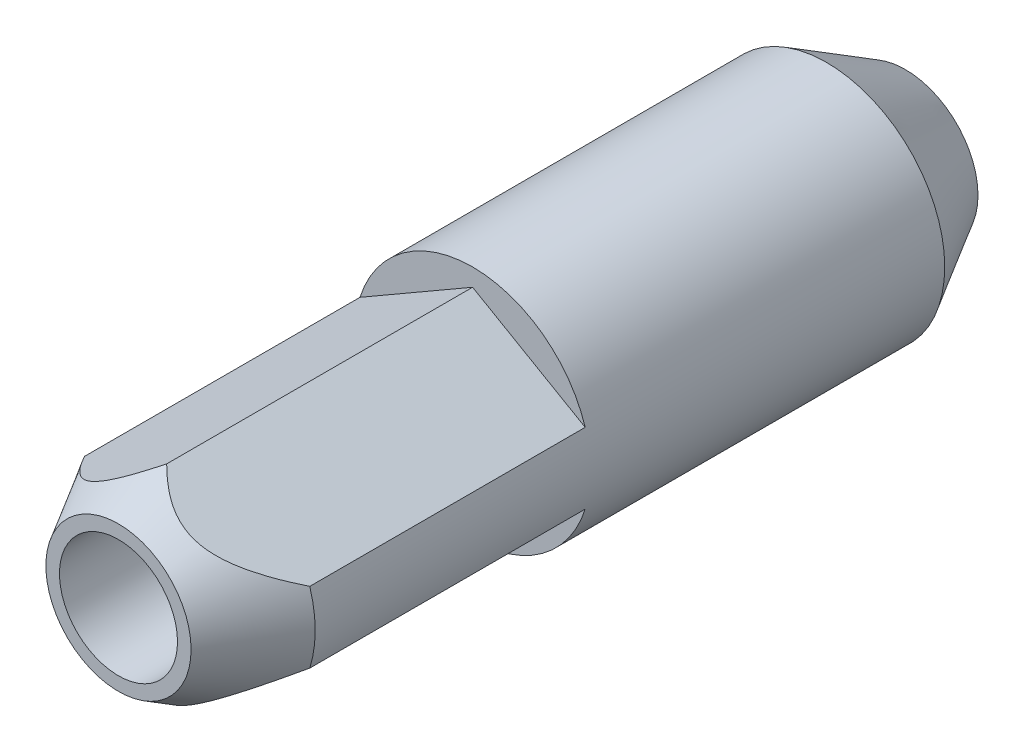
ISO-10303-21;
HEADER;
FILE_DESCRIPTION(('STEP AP214'),'2;1');
FILE_NAME('part.step','',(''),(''),'','','');
FILE_SCHEMA(('AUTOMOTIVE_DESIGN { 1 0 10303 214 1 1 1 1 }'));
ENDSEC;
DATA;
#1=APPLICATION_CONTEXT('core data for automotive mechanical design processes');
#2=APPLICATION_PROTOCOL_DEFINITION('international standard','automotive_design',2000,#1);
#3=PRODUCT_CONTEXT('',#1,'mechanical');
#4=PRODUCT('Part','Part','',(#3));
#5=PRODUCT_RELATED_PRODUCT_CATEGORY('part','',(#4));
#6=PRODUCT_DEFINITION_FORMATION('','',#4);
#7=PRODUCT_DEFINITION_CONTEXT('part definition',#1,'design');
#8=PRODUCT_DEFINITION('design','',#6,#7);
#9=PRODUCT_DEFINITION_SHAPE('','',#8);
#10=(LENGTH_UNIT() NAMED_UNIT(*) SI_UNIT(.MILLI.,.METRE.));
#11=(NAMED_UNIT(*) PLANE_ANGLE_UNIT() SI_UNIT($,.RADIAN.));
#12=(NAMED_UNIT(*) SI_UNIT($,.STERADIAN.) SOLID_ANGLE_UNIT());
#13=UNCERTAINTY_MEASURE_WITH_UNIT(LENGTH_MEASURE(1.E-05),#10,'distance_accuracy_value','');
#14=(GEOMETRIC_REPRESENTATION_CONTEXT(3) GLOBAL_UNCERTAINTY_ASSIGNED_CONTEXT((#13)) GLOBAL_UNIT_ASSIGNED_CONTEXT((#10,
#11,#12)) REPRESENTATION_CONTEXT('',''));
#15=CARTESIAN_POINT('',(0.,0.,0.));
#16=DIRECTION('',(0.,0.,1.));
#17=DIRECTION('',(1.,0.,0.));
#18=AXIS2_PLACEMENT_3D('',#15,#16,#17);
#19=CARTESIAN_POINT('',(0.,0.,18.));
#20=DIRECTION('',(0.,0.,-1.));
#21=DIRECTION('',(-1.,0.,0.));
#22=AXIS2_PLACEMENT_3D('',#19,#20,#21);
#23=CONICAL_SURFACE('',#22,3.,0.523598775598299);
#24=CARTESIAN_POINT('',(0.,0.,20.));
#25=DIRECTION('',(0.,0.,1.));
#26=DIRECTION('',(1.,0.,0.));
#27=AXIS2_PLACEMENT_3D('',#24,#25,#26);
#28=CIRCLE('',#27,1.84529946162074);
#29=CARTESIAN_POINT('',(1.84529946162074,0.,20.));
#30=VERTEX_POINT('',#29);
#31=EDGE_CURVE('E23',#30,#30,#28,.T.);
#32=ORIENTED_EDGE('',*,*,#31,.F.);
#33=EDGE_LOOP('',(#32));
#34=FACE_BOUND('',#33,.T.);
#35=CARTESIAN_POINT('',(-0.000199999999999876,2.55238663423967,18.7752890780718));
#36=CARTESIAN_POINT('',(0.0460344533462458,2.52569316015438,18.8214743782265));
#37=CARTESIAN_POINT('',(0.0931933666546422,2.49846594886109,18.8665157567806));
#38=CARTESIAN_POINT('',(0.189955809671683,2.44260012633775,18.9535711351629));
#39=CARTESIAN_POINT('',(0.239571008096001,2.41395477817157,18.9955677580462));
#40=CARTESIAN_POINT('',(0.34269103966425,2.3544184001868,19.0763265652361));
#41=CARTESIAN_POINT('',(0.396263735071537,2.32348819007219,19.1149751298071));
#42=CARTESIAN_POINT('',(0.506284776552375,2.25996751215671,19.186101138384));
#43=CARTESIAN_POINT('',(0.562726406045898,2.22738092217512,19.2185922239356));
#44=CARTESIAN_POINT('',(0.683762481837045,2.15750071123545,19.2779748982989));
#45=CARTESIAN_POINT('',(0.748638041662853,2.12004478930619,19.3041269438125));
#46=CARTESIAN_POINT('',(0.880771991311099,2.04375721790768,19.3437172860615));
#47=CARTESIAN_POINT('',(0.948006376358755,2.00493942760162,19.3572584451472));
#48=CARTESIAN_POINT('',(1.08417192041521,1.92632421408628,19.3699471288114));
#49=CARTESIAN_POINT('',(1.15311305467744,1.88652103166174,19.3689592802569));
#50=CARTESIAN_POINT('',(1.28973218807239,1.80764393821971,19.3524236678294));
#51=CARTESIAN_POINT('',(1.35740744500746,1.76857161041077,19.3368473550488));
#52=CARTESIAN_POINT('',(1.50861090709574,1.6812742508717,19.2872489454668));
#53=CARTESIAN_POINT('',(1.59113279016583,1.63363021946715,19.2492234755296));
#54=CARTESIAN_POINT('',(1.71058416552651,1.56466493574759,19.1815694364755));
#55=CARTESIAN_POINT('',(1.74986876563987,1.54198396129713,19.1570960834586));
#56=CARTESIAN_POINT('',(1.82697593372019,1.49746611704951,19.105250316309));
#57=CARTESIAN_POINT('',(1.86479886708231,1.47562903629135,19.0778786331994));
#58=CARTESIAN_POINT('',(1.94909791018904,1.42695896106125,19.0130933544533));
#59=CARTESIAN_POINT('',(1.99515689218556,1.40036679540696,18.9749623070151));
#60=CARTESIAN_POINT('',(2.08535834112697,1.34828896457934,18.8957734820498));
#61=CARTESIAN_POINT('',(2.12950000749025,1.32280376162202,18.8547145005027));
#62=CARTESIAN_POINT('',(2.25966628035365,1.24765222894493,18.7279277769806));
#63=CARTESIAN_POINT('',(2.34319057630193,1.19942945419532,18.6387853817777));
#64=CARTESIAN_POINT('',(2.50121771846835,1.10819244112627,18.459425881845));
#65=CARTESIAN_POINT('',(2.5759629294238,1.0650382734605,18.369486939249));
#66=CARTESIAN_POINT('',(2.68528856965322,1.00191908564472,18.2322142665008));
#67=CARTESIAN_POINT('',(2.72114587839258,0.981216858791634,18.1862256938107));
#68=CARTESIAN_POINT('',(2.79211447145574,0.940243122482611,18.0935055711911));
#69=CARTESIAN_POINT('',(2.82722592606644,0.919971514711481,18.0467741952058));
#70=CARTESIAN_POINT('',(2.86201760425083,0.899884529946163,17.99972953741));
#71=B_SPLINE_CURVE_WITH_KNOTS('',3,(#35,#36,#37,#38,#39,#40,#41,#42,#43,#44,#45,#46,#47,#48,#49,
#50,#51,#52,#53,#54,#55,#56,#57,#58,#59,#60,#61,#62,#63,#64,#65,#66,#67,#68,#69,#70),
.UNSPECIFIED.,.F.,.F.,(4,2,2,2,2,2,2,2,2,2,2,2,2,2,2,2,2,4),(0.,0.211847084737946,
0.424820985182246,0.643376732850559,0.861442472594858,1.09860494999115,1.33381558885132,
1.57121916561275,1.80908830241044,2.11503689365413,2.26959857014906,2.42412135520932,
2.62031527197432,2.81659033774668,3.21015736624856,3.58398424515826,3.76961845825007,
3.9552098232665),.UNSPECIFIED.);
#72=CARTESIAN_POINT('',(0.,2.55227116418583,18.7754890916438));
#73=VERTEX_POINT('',#72);
#74=CARTESIAN_POINT('',(2.86181760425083,0.9,18.));
#75=VERTEX_POINT('',#74);
#76=EDGE_CURVE('E102',#73,#75,#71,.T.);
#77=ORIENTED_EDGE('',*,*,#76,.F.);
#78=CARTESIAN_POINT('',(0.000199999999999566,2.55238663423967,18.7752890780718));
#79=CARTESIAN_POINT('',(-0.0460344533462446,2.52569316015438,18.8214743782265));
#80=CARTESIAN_POINT('',(-0.0931933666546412,2.49846594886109,18.8665157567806));
#81=CARTESIAN_POINT('',(-0.189955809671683,2.44260012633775,18.9535711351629));
#82=CARTESIAN_POINT('',(-0.239571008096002,2.41395477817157,18.9955677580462));
#83=CARTESIAN_POINT('',(-0.342691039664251,2.3544184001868,19.0763265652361));
#84=CARTESIAN_POINT('',(-0.396263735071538,2.32348819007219,19.1149751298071));
#85=CARTESIAN_POINT('',(-0.506284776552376,2.25996751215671,19.186101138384));
#86=CARTESIAN_POINT('',(-0.562726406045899,2.22738092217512,19.2185922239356));
#87=CARTESIAN_POINT('',(-0.683762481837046,2.15750071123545,19.2779748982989));
#88=CARTESIAN_POINT('',(-0.748638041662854,2.12004478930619,19.3041269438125));
#89=CARTESIAN_POINT('',(-0.8807719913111,2.04375721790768,19.3437172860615));
#90=CARTESIAN_POINT('',(-0.948006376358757,2.00493942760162,19.3572584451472));
#91=CARTESIAN_POINT('',(-1.08417192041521,1.92632421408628,19.3699471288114));
#92=CARTESIAN_POINT('',(-1.15311305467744,1.88652103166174,19.3689592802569));
#93=CARTESIAN_POINT('',(-1.28973218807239,1.80764393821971,19.3524236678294));
#94=CARTESIAN_POINT('',(-1.35740744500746,1.76857161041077,19.3368473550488));
#95=CARTESIAN_POINT('',(-1.50861090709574,1.6812742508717,19.2872489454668));
#96=CARTESIAN_POINT('',(-1.59113279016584,1.63363021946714,19.2492234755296));
#97=CARTESIAN_POINT('',(-1.71058416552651,1.56466493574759,19.1815694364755));
#98=CARTESIAN_POINT('',(-1.74986876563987,1.54198396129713,19.1570960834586));
#99=CARTESIAN_POINT('',(-1.82697593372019,1.49746611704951,19.105250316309));
#100=CARTESIAN_POINT('',(-1.86479886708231,1.47562903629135,19.0778786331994));
#101=CARTESIAN_POINT('',(-1.94909791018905,1.42695896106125,19.0130933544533));
#102=CARTESIAN_POINT('',(-1.99515689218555,1.40036679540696,18.9749623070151));
#103=CARTESIAN_POINT('',(-2.08535834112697,1.34828896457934,18.8957734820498));
#104=CARTESIAN_POINT('',(-2.12950000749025,1.32280376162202,18.8547145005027));
#105=CARTESIAN_POINT('',(-2.25966628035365,1.24765222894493,18.7279277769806));
#106=CARTESIAN_POINT('',(-2.34319057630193,1.19942945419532,18.6387853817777));
#107=CARTESIAN_POINT('',(-2.50121771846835,1.10819244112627,18.459425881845));
#108=CARTESIAN_POINT('',(-2.5759629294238,1.0650382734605,18.369486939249));
#109=CARTESIAN_POINT('',(-2.68528856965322,1.00191908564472,18.2322142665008));
#110=CARTESIAN_POINT('',(-2.72114587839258,0.981216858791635,18.1862256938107));
#111=CARTESIAN_POINT('',(-2.79211447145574,0.94024312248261,18.0935055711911));
#112=CARTESIAN_POINT('',(-2.82722592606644,0.91997151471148,18.0467741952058));
#113=CARTESIAN_POINT('',(-2.86201760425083,0.899884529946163,17.99972953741));
#114=B_SPLINE_CURVE_WITH_KNOTS('',3,(#78,#79,#80,#81,#82,#83,#84,#85,#86,#87,#88,#89,#90,#91,
#92,#93,#94,#95,#96,#97,#98,#99,#100,#101,#102,#103,#104,#105,#106,#107,#108,#109,#110,#111,
#112,#113),.UNSPECIFIED.,.F.,.F.,(4,2,2,2,2,2,2,2,2,2,2,2,2,2,2,2,2,4),(0.,0.211847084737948,
0.424820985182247,0.64337673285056,0.861442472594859,1.09860494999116,1.33381558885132,
1.57121916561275,1.80908830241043,2.11503689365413,2.26959857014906,2.42412135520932,
2.62031527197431,2.81659033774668,3.21015736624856,3.58398424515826,3.76961845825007,
3.9552098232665),.UNSPECIFIED.);
#115=CARTESIAN_POINT('',(-2.86181760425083,0.9,18.));
#116=VERTEX_POINT('',#115);
#117=EDGE_CURVE('E75',#73,#116,#114,.T.);
#118=ORIENTED_EDGE('',*,*,#117,.T.);
#119=CARTESIAN_POINT('',(0.,0.,18.));
#120=DIRECTION('',(0.,0.,1.));
#121=DIRECTION('',(1.,0.,0.));
#122=AXIS2_PLACEMENT_3D('',#119,#120,#121);
#123=CIRCLE('',#122,3.);
#124=CARTESIAN_POINT('',(-2.86181760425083,-0.9,18.));
#125=VERTEX_POINT('',#124);
#126=EDGE_CURVE('E155',#116,#125,#123,.T.);
#127=ORIENTED_EDGE('',*,*,#126,.T.);
#128=CARTESIAN_POINT('',(0.0002,-2.55238663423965,18.7752890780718));
#129=CARTESIAN_POINT('',(-0.0460344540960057,-2.52569315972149,18.8214743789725));
#130=CARTESIAN_POINT('',(-0.0931933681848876,-2.49846594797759,18.8665157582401));
#131=CARTESIAN_POINT('',(-0.189955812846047,-2.44260012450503,18.9535711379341));
#132=CARTESIAN_POINT('',(-0.239571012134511,-2.41395477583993,18.9955677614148));
#133=CARTESIAN_POINT('',(-0.342691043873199,-2.35441839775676,19.0763265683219));
#134=CARTESIAN_POINT('',(-0.396263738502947,-2.32348818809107,19.1149751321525));
#135=CARTESIAN_POINT('',(-0.506284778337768,-2.2599675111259,19.1861011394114));
#136=CARTESIAN_POINT('',(-0.562726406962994,-2.22738092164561,19.2185922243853));
#137=CARTESIAN_POINT('',(-0.683762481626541,-2.15750071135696,19.277974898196));
#138=CARTESIAN_POINT('',(-0.74863804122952,-2.12004478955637,19.3041269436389));
#139=CARTESIAN_POINT('',(-0.880771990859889,-2.04375721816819,19.3437172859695));
#140=CARTESIAN_POINT('',(-0.948006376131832,-2.00493942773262,19.3572584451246));
#141=CARTESIAN_POINT('',(-1.08417191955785,-1.92632421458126,19.3699471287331));
#142=CARTESIAN_POINT('',(-1.15311305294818,-1.88652103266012,19.3689592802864));
#143=CARTESIAN_POINT('',(-1.289732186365,-1.80764393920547,19.3524236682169));
#144=CARTESIAN_POINT('',(-1.35740744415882,-1.76857161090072,19.3368473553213));
#145=CARTESIAN_POINT('',(-1.50861091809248,-1.68127424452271,19.2872489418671));
#146=CARTESIAN_POINT('',(-1.59113281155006,-1.63363020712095,19.2492234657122));
#147=CARTESIAN_POINT('',(-1.71058419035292,-1.56466492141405,19.1815694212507));
#148=CARTESIAN_POINT('',(-1.7498687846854,-1.54198395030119,19.1570960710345));
#149=CARTESIAN_POINT('',(-1.82697594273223,-1.4974661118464,19.1052503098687));
#150=CARTESIAN_POINT('',(-1.864798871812,-1.47562903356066,19.0778786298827));
#151=CARTESIAN_POINT('',(-1.94909496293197,-1.4269606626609,19.0130956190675));
#152=CARTESIAN_POINT('',(-1.99515113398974,-1.40037011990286,18.9749670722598));
#153=CARTESIAN_POINT('',(-2.0853471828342,-1.34829540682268,18.8957835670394));
#154=CARTESIAN_POINT('',(-2.12948626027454,-1.32281169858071,18.8547274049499));
#155=CARTESIAN_POINT('',(-2.2596449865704,-1.24766452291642,18.727949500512));
#156=CARTESIAN_POINT('',(-2.34316459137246,-1.19944445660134,18.6388134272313));
#157=CARTESIAN_POINT('',(-2.50118334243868,-1.10821228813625,18.459466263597));
#158=CARTESIAN_POINT('',(-2.57592481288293,-1.06506028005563,18.3695332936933));
#159=CARTESIAN_POINT('',(-2.68524504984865,-1.0019442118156,18.232269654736));
#160=CARTESIAN_POINT('',(-2.72110061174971,-0.981242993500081,18.1862840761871));
#161=CARTESIAN_POINT('',(-2.79206575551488,-0.940271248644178,18.0935699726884));
#162=CARTESIAN_POINT('',(-2.82717550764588,-0.920000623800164,18.0468416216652));
#163=CARTESIAN_POINT('',(-2.86196550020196,-0.899914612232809,17.9998));
#164=B_SPLINE_CURVE_WITH_KNOTS('',3,(#128,#129,#130,#131,#132,#133,#134,#135,#136,#137,#138,
#139,#140,#141,#142,#143,#144,#145,#146,#147,#148,#149,#150,#151,#152,#153,#154,#155,#156,#157,
#158,#159,#160,#161,#162,#163),.UNSPECIFIED.,.F.,.F.,(4,2,2,2,2,2,2,2,2,2,2,2,2,2,2,2,2,4),(0.,
0.2118470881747,0.424820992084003,0.643376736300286,0.861442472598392,1.09860494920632,
1.3338155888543,1.57121916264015,1.80908830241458,2.11503693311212,2.26959858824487,
2.42412135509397,2.62030301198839,2.81656579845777,3.21010807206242,3.58391305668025,
3.76953654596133,3.95511719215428),.UNSPECIFIED.);
#165=CARTESIAN_POINT('',(0.,-2.55227116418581,18.7754890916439));
#166=VERTEX_POINT('',#165);
#167=EDGE_CURVE('E129',#166,#125,#164,.T.);
#168=ORIENTED_EDGE('',*,*,#167,.F.);
#169=CARTESIAN_POINT('',(-0.000200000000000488,-2.55238663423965,18.7752890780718));
#170=CARTESIAN_POINT('',(0.0460344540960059,-2.52569315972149,18.8214743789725));
#171=CARTESIAN_POINT('',(0.0931933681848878,-2.49846594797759,18.8665157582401));
#172=CARTESIAN_POINT('',(0.189955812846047,-2.44260012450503,18.9535711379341));
#173=CARTESIAN_POINT('',(0.23957101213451,-2.41395477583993,18.9955677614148));
#174=CARTESIAN_POINT('',(0.342691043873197,-2.35441839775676,19.0763265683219));
#175=CARTESIAN_POINT('',(0.396263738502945,-2.32348818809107,19.1149751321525));
#176=CARTESIAN_POINT('',(0.506284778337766,-2.2599675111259,19.1861011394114));
#177=CARTESIAN_POINT('',(0.562726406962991,-2.22738092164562,19.2185922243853));
#178=CARTESIAN_POINT('',(0.683762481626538,-2.15750071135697,19.277974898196));
#179=CARTESIAN_POINT('',(0.748638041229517,-2.12004478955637,19.3041269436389));
#180=CARTESIAN_POINT('',(0.880771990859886,-2.04375721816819,19.3437172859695));
#181=CARTESIAN_POINT('',(0.948006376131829,-2.00493942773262,19.3572584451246));
#182=CARTESIAN_POINT('',(1.08417191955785,-1.92632421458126,19.3699471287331));
#183=CARTESIAN_POINT('',(1.15311305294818,-1.88652103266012,19.3689592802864));
#184=CARTESIAN_POINT('',(1.289732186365,-1.80764393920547,19.3524236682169));
#185=CARTESIAN_POINT('',(1.35740744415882,-1.76857161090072,19.3368473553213));
#186=CARTESIAN_POINT('',(1.50861091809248,-1.68127424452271,19.2872489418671));
#187=CARTESIAN_POINT('',(1.59113281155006,-1.63363020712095,19.2492234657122));
#188=CARTESIAN_POINT('',(1.71058419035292,-1.56466492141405,19.1815694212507));
#189=CARTESIAN_POINT('',(1.7498687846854,-1.54198395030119,19.1570960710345));
#190=CARTESIAN_POINT('',(1.82697594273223,-1.4974661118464,19.1052503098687));
#191=CARTESIAN_POINT('',(1.864798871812,-1.47562903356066,19.0778786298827));
#192=CARTESIAN_POINT('',(1.94909496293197,-1.4269606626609,19.0130956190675));
#193=CARTESIAN_POINT('',(1.99515113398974,-1.40037011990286,18.9749670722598));
#194=CARTESIAN_POINT('',(2.0853471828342,-1.34829540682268,18.8957835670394));
#195=CARTESIAN_POINT('',(2.12948626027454,-1.32281169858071,18.8547274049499));
#196=CARTESIAN_POINT('',(2.2596449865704,-1.24766452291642,18.727949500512));
#197=CARTESIAN_POINT('',(2.34316459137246,-1.19944445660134,18.6388134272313));
#198=CARTESIAN_POINT('',(2.50118334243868,-1.10821228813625,18.459466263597));
#199=CARTESIAN_POINT('',(2.57592481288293,-1.06506028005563,18.3695332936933));
#200=CARTESIAN_POINT('',(2.68524504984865,-1.0019442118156,18.232269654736));
#201=CARTESIAN_POINT('',(2.72110061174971,-0.981242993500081,18.1862840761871));
#202=CARTESIAN_POINT('',(2.79206575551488,-0.940271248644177,18.0935699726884));
#203=CARTESIAN_POINT('',(2.82717550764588,-0.920000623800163,18.0468416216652));
#204=CARTESIAN_POINT('',(2.86196550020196,-0.899914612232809,17.9998));
#205=B_SPLINE_CURVE_WITH_KNOTS('',3,(#169,#170,#171,#172,#173,#174,#175,#176,#177,#178,#179,
#180,#181,#182,#183,#184,#185,#186,#187,#188,#189,#190,#191,#192,#193,#194,#195,#196,#197,#198,
#199,#200,#201,#202,#203,#204),.UNSPECIFIED.,.F.,.F.,(4,2,2,2,2,2,2,2,2,2,2,2,2,2,2,2,2,4),(0.,
0.2118470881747,0.424820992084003,0.643376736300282,0.861442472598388,1.09860494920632,
1.33381558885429,1.57121916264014,1.80908830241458,2.11503693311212,2.26959858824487,
2.42412135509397,2.62030301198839,2.81656579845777,3.21010807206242,3.58391305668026,
3.76953654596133,3.95511719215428),.UNSPECIFIED.);
#206=CARTESIAN_POINT('',(2.86181760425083,-0.9,18.));
#207=VERTEX_POINT('',#206);
#208=EDGE_CURVE('E138',#166,#207,#205,.T.);
#209=ORIENTED_EDGE('',*,*,#208,.T.);
#210=EDGE_CURVE('E156',#207,#75,#123,.T.);
#211=ORIENTED_EDGE('',*,*,#210,.T.);
#212=EDGE_LOOP('',(#77,#118,#127,#168,#209,#211));
#213=FACE_BOUND('',#212,.T.);
#214=ADVANCED_FACE('F15',(#34,#213),#23,.T.);
#215=CARTESIAN_POINT('',(0.,0.,30.));
#216=DIRECTION('',(0.,0.,1.));
#217=DIRECTION('',(1.,0.,0.));
#218=AXIS2_PLACEMENT_3D('',#215,#216,#217);
#219=CYLINDRICAL_SURFACE('',#218,3.);
#220=CARTESIAN_POINT('',(0.,0.,2.));
#221=DIRECTION('',(0.,0.,1.));
#222=DIRECTION('',(1.,0.,0.));
#223=AXIS2_PLACEMENT_3D('',#220,#221,#222);
#224=CIRCLE('',#223,3.);
#225=CARTESIAN_POINT('',(3.,0.,2.));
#226=VERTEX_POINT('',#225);
#227=EDGE_CURVE('E152',#226,#226,#224,.T.);
#228=ORIENTED_EDGE('',*,*,#227,.T.);
#229=EDGE_LOOP('',(#228));
#230=FACE_BOUND('',#229,.T.);
#231=DIRECTION('',(0.,0.,1.));
#232=VECTOR('',#231,1.);
#233=CARTESIAN_POINT('',(2.86181760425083,0.9,11.));
#234=LINE('',#233,#232);
#235=CARTESIAN_POINT('',(2.86181760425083,0.9,11.));
#236=VERTEX_POINT('',#235);
#237=EDGE_CURVE('E82',#236,#75,#234,.T.);
#238=ORIENTED_EDGE('',*,*,#237,.T.);
#239=ORIENTED_EDGE('',*,*,#210,.F.);
#240=DIRECTION('',(0.,0.,1.));
#241=VECTOR('',#240,1.);
#242=CARTESIAN_POINT('',(2.86181760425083,-0.9,11.));
#243=LINE('',#242,#241);
#244=CARTESIAN_POINT('',(2.86181760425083,-0.9,11.));
#245=VERTEX_POINT('',#244);
#246=EDGE_CURVE('E179',#245,#207,#243,.T.);
#247=ORIENTED_EDGE('',*,*,#246,.F.);
#248=CARTESIAN_POINT('',(0.,0.,11.));
#249=DIRECTION('',(0.,0.,1.));
#250=DIRECTION('',(1.,0.,0.));
#251=AXIS2_PLACEMENT_3D('',#248,#249,#250);
#252=CIRCLE('',#251,3.);
#253=CARTESIAN_POINT('',(-2.86181760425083,-0.9,11.));
#254=VERTEX_POINT('',#253);
#255=EDGE_CURVE('E169',#254,#245,#252,.T.);
#256=ORIENTED_EDGE('',*,*,#255,.F.);
#257=DIRECTION('',(0.,0.,1.));
#258=VECTOR('',#257,1.);
#259=CARTESIAN_POINT('',(-2.86181760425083,-0.9,11.));
#260=LINE('',#259,#258);
#261=EDGE_CURVE('E176',#254,#125,#260,.T.);
#262=ORIENTED_EDGE('',*,*,#261,.T.);
#263=ORIENTED_EDGE('',*,*,#126,.F.);
#264=DIRECTION('',(0.,0.,1.));
#265=VECTOR('',#264,1.);
#266=CARTESIAN_POINT('',(-2.86181760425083,0.9,11.));
#267=LINE('',#266,#265);
#268=CARTESIAN_POINT('',(-2.86181760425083,0.9,11.));
#269=VERTEX_POINT('',#268);
#270=EDGE_CURVE('E78',#269,#116,#267,.T.);
#271=ORIENTED_EDGE('',*,*,#270,.F.);
#272=CARTESIAN_POINT('',(0.,0.,11.));
#273=DIRECTION('',(0.,0.,1.));
#274=DIRECTION('',(1.,0.,0.));
#275=AXIS2_PLACEMENT_3D('',#272,#273,#274);
#276=CIRCLE('',#275,3.);
#277=EDGE_CURVE('E86',#236,#269,#276,.T.);
#278=ORIENTED_EDGE('',*,*,#277,.F.);
#279=EDGE_LOOP('',(#238,#239,#247,#256,#262,#263,#271,#278));
#280=FACE_BOUND('',#279,.T.);
#281=ADVANCED_FACE('F165',(#230,#280),#219,.T.);
#282=CARTESIAN_POINT('',(0.,0.,30.));
#283=DIRECTION('',(0.,0.,1.));
#284=DIRECTION('',(1.,0.,0.));
#285=AXIS2_PLACEMENT_3D('',#282,#283,#284);
#286=CYLINDRICAL_SURFACE('',#285,1.5);
#287=CARTESIAN_POINT('',(0.,0.,14.));
#288=DIRECTION('',(0.,0.,1.));
#289=DIRECTION('',(1.,0.,0.));
#290=AXIS2_PLACEMENT_3D('',#287,#288,#289);
#291=CIRCLE('',#290,1.5);
#292=CARTESIAN_POINT('',(1.5,0.,14.));
#293=VERTEX_POINT('',#292);
#294=EDGE_CURVE('E89',#293,#293,#291,.T.);
#295=ORIENTED_EDGE('',*,*,#294,.F.);
#296=EDGE_LOOP('',(#295));
#297=FACE_BOUND('',#296,.T.);
#298=CARTESIAN_POINT('',(0.,0.,20.));
#299=DIRECTION('',(0.,0.,1.));
#300=DIRECTION('',(1.,0.,0.));
#301=AXIS2_PLACEMENT_3D('',#298,#299,#300);
#302=CIRCLE('',#301,1.5);
#303=CARTESIAN_POINT('',(1.5,0.,20.));
#304=VERTEX_POINT('',#303);
#305=EDGE_CURVE('E9',#304,#304,#302,.T.);
#306=ORIENTED_EDGE('',*,*,#305,.T.);
#307=EDGE_LOOP('',(#306));
#308=FACE_BOUND('',#307,.T.);
#309=ADVANCED_FACE('F17',(#297,#308),#286,.F.);
#310=CARTESIAN_POINT('',(1.84529946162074,0.,20.));
#311=DIRECTION('',(0.,0.,-1.));
#312=DIRECTION('',(-1.,0.,0.));
#313=AXIS2_PLACEMENT_3D('',#310,#311,#312);
#314=PLANE('',#313);
#315=ORIENTED_EDGE('',*,*,#305,.F.);
#316=EDGE_LOOP('',(#315));
#317=FACE_BOUND('',#316,.T.);
#318=ORIENTED_EDGE('',*,*,#31,.T.);
#319=EDGE_LOOP('',(#318));
#320=FACE_BOUND('',#319,.T.);
#321=ADVANCED_FACE('F161',(#317,#320),#314,.F.);
#322=CARTESIAN_POINT('',(0.,0.,0.));
#323=DIRECTION('',(0.,0.,1.));
#324=DIRECTION('',(1.,0.,0.));
#325=AXIS2_PLACEMENT_3D('',#322,#323,#324);
#326=CONICAL_SURFACE('',#325,1.84529946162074,0.523598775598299);
#327=ORIENTED_EDGE('',*,*,#227,.F.);
#328=EDGE_LOOP('',(#327));
#329=FACE_BOUND('',#328,.T.);
#330=CARTESIAN_POINT('',(0.,0.,0.));
#331=DIRECTION('',(0.,0.,1.));
#332=DIRECTION('',(1.,0.,0.));
#333=AXIS2_PLACEMENT_3D('',#330,#331,#332);
#334=CIRCLE('',#333,1.84529946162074);
#335=CARTESIAN_POINT('',(1.84529946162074,0.,0.));
#336=VERTEX_POINT('',#335);
#337=EDGE_CURVE('E149',#336,#336,#334,.T.);
#338=ORIENTED_EDGE('',*,*,#337,.T.);
#339=EDGE_LOOP('',(#338));
#340=FACE_BOUND('',#339,.T.);
#341=ADVANCED_FACE('F252',(#329,#340),#326,.T.);
#342=CARTESIAN_POINT('',(1.,0.,0.));
#343=DIRECTION('',(0.,0.,1.));
#344=DIRECTION('',(1.,0.,0.));
#345=AXIS2_PLACEMENT_3D('',#342,#343,#344);
#346=PLANE('',#345);
#347=ORIENTED_EDGE('',*,*,#337,.F.);
#348=EDGE_LOOP('',(#347));
#349=FACE_BOUND('',#348,.T.);
#350=CARTESIAN_POINT('',(0.,0.,0.));
#351=DIRECTION('',(0.,0.,1.));
#352=DIRECTION('',(1.,0.,0.));
#353=AXIS2_PLACEMENT_3D('',#350,#351,#352);
#354=CIRCLE('',#353,1.);
#355=CARTESIAN_POINT('',(1.,0.,0.));
#356=VERTEX_POINT('',#355);
#357=EDGE_CURVE('E146',#356,#356,#354,.T.);
#358=ORIENTED_EDGE('',*,*,#357,.T.);
#359=EDGE_LOOP('',(#358));
#360=FACE_BOUND('',#359,.T.);
#361=ADVANCED_FACE('F257',(#349,#360),#346,.F.);
#362=CARTESIAN_POINT('',(0.,0.,30.));
#363=DIRECTION('',(0.,0.,1.));
#364=DIRECTION('',(1.,0.,0.));
#365=AXIS2_PLACEMENT_3D('',#362,#363,#364);
#366=CYLINDRICAL_SURFACE('',#365,1.);
#367=ORIENTED_EDGE('',*,*,#357,.F.);
#368=EDGE_LOOP('',(#367));
#369=FACE_BOUND('',#368,.T.);
#370=CARTESIAN_POINT('',(0.,0.,4.));
#371=DIRECTION('',(0.,0.,1.));
#372=DIRECTION('',(1.,0.,0.));
#373=AXIS2_PLACEMENT_3D('',#370,#371,#372);
#374=CIRCLE('',#373,1.);
#375=CARTESIAN_POINT('',(1.,0.,4.));
#376=VERTEX_POINT('',#375);
#377=EDGE_CURVE('E137',#376,#376,#374,.T.);
#378=ORIENTED_EDGE('',*,*,#377,.T.);
#379=EDGE_LOOP('',(#378));
#380=FACE_BOUND('',#379,.T.);
#381=ADVANCED_FACE('F266',(#369,#380),#366,.F.);
#382=CARTESIAN_POINT('',(0.,0.,4.));
#383=DIRECTION('',(0.,0.,1.));
#384=DIRECTION('',(1.,0.,0.));
#385=AXIS2_PLACEMENT_3D('',#382,#383,#384);
#386=PLANE('',#385);
#387=ORIENTED_EDGE('',*,*,#377,.F.);
#388=EDGE_LOOP('',(#387));
#389=FACE_BOUND('',#388,.T.);
#390=ADVANCED_FACE('F124',(#389),#386,.F.);
#391=CARTESIAN_POINT('',(-2.86181760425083,-0.9,11.));
#392=DIRECTION('',(-0.5,-0.866025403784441,0.));
#393=DIRECTION('',(0.866025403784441,-0.5,0.));
#394=AXIS2_PLACEMENT_3D('',#391,#392,#393);
#395=PLANE('',#394);
#396=ORIENTED_EDGE('',*,*,#167,.T.);
#397=ORIENTED_EDGE('',*,*,#261,.F.);
#398=DIRECTION('',(0.866025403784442,-0.5,0.));
#399=VECTOR('',#398,1.);
#400=CARTESIAN_POINT('',(-2.86181760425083,-0.9,11.));
#401=LINE('',#400,#399);
#402=CARTESIAN_POINT('',(0.,-2.55227116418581,11.));
#403=VERTEX_POINT('',#402);
#404=EDGE_CURVE('E38',#254,#403,#401,.T.);
#405=ORIENTED_EDGE('',*,*,#404,.T.);
#406=DIRECTION('',(0.,0.,1.));
#407=VECTOR('',#406,1.);
#408=CARTESIAN_POINT('',(0.,-2.55227116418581,11.));
#409=LINE('',#408,#407);
#410=EDGE_CURVE('E180',#403,#166,#409,.T.);
#411=ORIENTED_EDGE('',*,*,#410,.T.);
#412=EDGE_LOOP('',(#396,#397,#405,#411));
#413=FACE_BOUND('',#412,.T.);
#414=ADVANCED_FACE('F120',(#413),#395,.T.);
#415=CARTESIAN_POINT('',(2.86181760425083,-0.9,11.));
#416=DIRECTION('',(-0.5,0.866025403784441,0.));
#417=DIRECTION('',(-0.866025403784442,-0.5,0.));
#418=AXIS2_PLACEMENT_3D('',#415,#416,#417);
#419=PLANE('',#418);
#420=ORIENTED_EDGE('',*,*,#410,.F.);
#421=DIRECTION('',(-0.866025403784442,-0.5,0.));
#422=VECTOR('',#421,1.);
#423=CARTESIAN_POINT('',(2.86181760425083,-0.9,11.));
#424=LINE('',#423,#422);
#425=EDGE_CURVE('E170',#245,#403,#424,.T.);
#426=ORIENTED_EDGE('',*,*,#425,.F.);
#427=ORIENTED_EDGE('',*,*,#246,.T.);
#428=ORIENTED_EDGE('',*,*,#208,.F.);
#429=EDGE_LOOP('',(#420,#426,#427,#428));
#430=FACE_BOUND('',#429,.T.);
#431=ADVANCED_FACE('F119',(#430),#419,.F.);
#432=CARTESIAN_POINT('',(0.,0.,11.));
#433=DIRECTION('',(0.,0.,1.));
#434=DIRECTION('',(1.,0.,0.));
#435=AXIS2_PLACEMENT_3D('',#432,#433,#434);
#436=PLANE('',#435);
#437=ORIENTED_EDGE('',*,*,#404,.F.);
#438=ORIENTED_EDGE('',*,*,#255,.T.);
#439=ORIENTED_EDGE('',*,*,#425,.T.);
#440=EDGE_LOOP('',(#437,#438,#439));
#441=FACE_BOUND('',#440,.T.);
#442=ADVANCED_FACE('F116',(#441),#436,.T.);
#443=CARTESIAN_POINT('',(2.86181760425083,0.9,11.));
#444=DIRECTION('',(0.5,0.866025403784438,0.));
#445=DIRECTION('',(-0.866025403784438,0.5,0.));
#446=AXIS2_PLACEMENT_3D('',#443,#444,#445);
#447=PLANE('',#446);
#448=ORIENTED_EDGE('',*,*,#76,.T.);
#449=ORIENTED_EDGE('',*,*,#237,.F.);
#450=DIRECTION('',(-0.866025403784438,0.5,0.));
#451=VECTOR('',#450,1.);
#452=CARTESIAN_POINT('',(2.86181760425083,0.9,11.));
#453=LINE('',#452,#451);
#454=CARTESIAN_POINT('',(0.,2.55227116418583,11.));
#455=VERTEX_POINT('',#454);
#456=EDGE_CURVE('E30',#236,#455,#453,.T.);
#457=ORIENTED_EDGE('',*,*,#456,.T.);
#458=DIRECTION('',(0.,0.,1.));
#459=VECTOR('',#458,1.);
#460=CARTESIAN_POINT('',(0.,2.55227116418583,11.));
#461=LINE('',#460,#459);
#462=EDGE_CURVE('E71',#455,#73,#461,.T.);
#463=ORIENTED_EDGE('',*,*,#462,.T.);
#464=EDGE_LOOP('',(#448,#449,#457,#463));
#465=FACE_BOUND('',#464,.T.);
#466=ADVANCED_FACE('F80',(#465),#447,.T.);
#467=CARTESIAN_POINT('',(-2.86181760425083,0.9,11.));
#468=DIRECTION('',(0.5,-0.866025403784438,0.));
#469=DIRECTION('',(0.866025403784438,0.5,0.));
#470=AXIS2_PLACEMENT_3D('',#467,#468,#469);
#471=PLANE('',#470);
#472=ORIENTED_EDGE('',*,*,#462,.F.);
#473=DIRECTION('',(0.866025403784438,0.5,0.));
#474=VECTOR('',#473,1.);
#475=CARTESIAN_POINT('',(-2.86181760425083,0.9,11.));
#476=LINE('',#475,#474);
#477=EDGE_CURVE('E73',#269,#455,#476,.T.);
#478=ORIENTED_EDGE('',*,*,#477,.F.);
#479=ORIENTED_EDGE('',*,*,#270,.T.);
#480=ORIENTED_EDGE('',*,*,#117,.F.);
#481=EDGE_LOOP('',(#472,#478,#479,#480));
#482=FACE_BOUND('',#481,.T.);
#483=ADVANCED_FACE('F72',(#482),#471,.F.);
#484=CARTESIAN_POINT('',(0.,0.,11.));
#485=DIRECTION('',(0.,0.,1.));
#486=DIRECTION('',(1.,0.,0.));
#487=AXIS2_PLACEMENT_3D('',#484,#485,#486);
#488=PLANE('',#487);
#489=ORIENTED_EDGE('',*,*,#456,.F.);
#490=ORIENTED_EDGE('',*,*,#277,.T.);
#491=ORIENTED_EDGE('',*,*,#477,.T.);
#492=EDGE_LOOP('',(#489,#490,#491));
#493=FACE_BOUND('',#492,.T.);
#494=ADVANCED_FACE('F85',(#493),#488,.T.);
#495=CARTESIAN_POINT('',(0.,0.,14.));
#496=DIRECTION('',(0.,0.,1.));
#497=DIRECTION('',(1.,0.,0.));
#498=AXIS2_PLACEMENT_3D('',#495,#496,#497);
#499=PLANE('',#498);
#500=ORIENTED_EDGE('',*,*,#294,.T.);
#501=EDGE_LOOP('',(#500));
#502=FACE_BOUND('',#501,.T.);
#503=ADVANCED_FACE('F217',(#502),#499,.T.);
#504=CLOSED_SHELL('',(#214,#281,#309,#321,#341,#361,#381,#390,#414,#431,#442,#466,#483,#494,#503));
#505=MANIFOLD_SOLID_BREP('B1',#504);
#506=ADVANCED_BREP_SHAPE_REPRESENTATION('',(#18,#505),#14);
#507=SHAPE_DEFINITION_REPRESENTATION(#9,#506);
ENDSEC;
END-ISO-10303-21;
